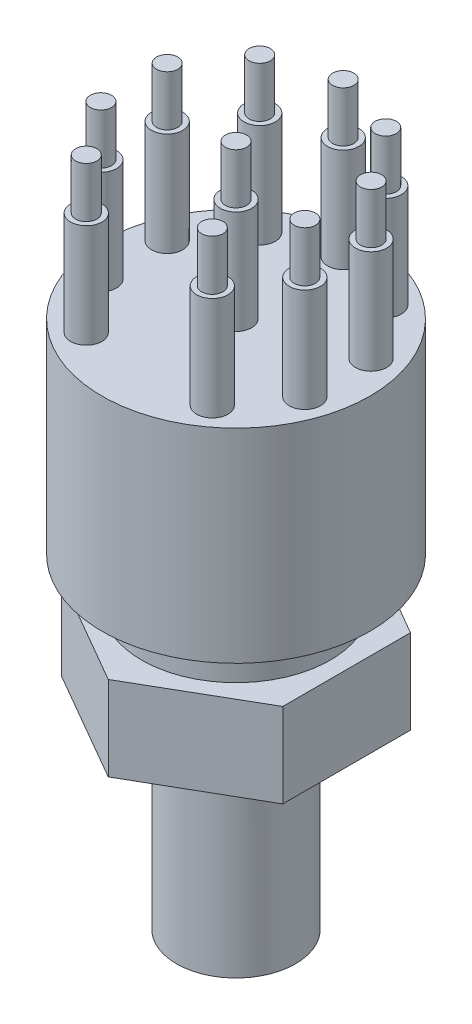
from build123d import *

# Parameters (mm, degrees)
EXTRUDE1_DEPTH    = 7.874
SKETCH2_W         = 8.8011
SKETCH2_H         = 4.18
SKETCH3_R         = 12.5
EXTRUDE2_DEPTH    = 19
SKETCH4_R         = 1.4605
EXTRUDE3_DEPTH    = 9.652
SKETCH5_R         = 0.9906
EXTRUDE4_DEPTH    = 4.699
CIRPATTERN1_COUNT = 10
SKETCH_1_R        = 1.4605
EXTRUDE5_DEPTH    = 9.652
SKETCH_2_R        = 0.9906
EXTRUDE6_DEPTH    = 4.699
SKETCH8_R         = 5.55625
EXTRUDE7_DEPTH    = 18.28030303
SKETCH9_R         = 0.89


with BuildPart() as part:
    # Sketch1 → Extrude1 (new body)
    with BuildSketch(Plane(origin=(0, 0, 0), x_dir=(1, 0, 0), z_dir=(0, 1, 0))):
        Polygon((0, 11.916509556), (-10.32, 5.958254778), (-10.32, -5.958254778), (0, -11.916509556), (10.32, -5.958254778), (10.32, 5.958254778), align=None)
    extrude(amount=EXTRUDE1_DEPTH)

    # Sketch2 → Revolve1 (revolve)
    with BuildSketch(Plane.XY, mode=Mode.PRIVATE) as revolve1_sk:
        with Locations((4.40055, 9.964)):
            Rectangle(SKETCH2_W, SKETCH2_H)
    revolve(revolve1_sk.sketch.rotate(Axis((0, 0, 0), (0, -1, 0)), 180), axis=Axis((0, 0, 0), (0, -1, 0)))

    # Sketch3 → Extrude2 (add)
    with BuildSketch(Plane(origin=(0, 12.054, 0), x_dir=(-1, 0, 0), z_dir=(0, 1, 0))):
        Circle(SKETCH3_R)
    extrude(amount=EXTRUDE2_DEPTH)

    # Sketch4 → Extrude3 (add)
    with BuildSketch(Plane(origin=(0, 31.054, 0), x_dir=(-1, 0, 0), z_dir=(0, 1, 0))):
        with Locations((0, -10)):
            Circle(SKETCH4_R)
    extrude3 = extrude(amount=EXTRUDE3_DEPTH)

    # Sketch5 → Extrude4 (add)
    with BuildSketch(Plane(origin=(0, 40.706, 0), x_dir=(-1, 0, 0), z_dir=(0, 1, 0))):
        with Locations((0, -10)):
            Circle(SKETCH5_R)
    extrude4 = extrude(amount=EXTRUDE4_DEPTH)

    # CirPattern1: Extrude3, Extrude4 ×10 about axis, 1 skipped
    cirpattern1_axis = Axis((0, 0, 0), (0, -1, 0))
    add([extrude3.rotate(cirpattern1_axis, i * 360 / CIRPATTERN1_COUNT) for i in range(1, CIRPATTERN1_COUNT) if i not in (5,)])
    add([extrude4.rotate(cirpattern1_axis, i * 360 / CIRPATTERN1_COUNT) for i in range(1, CIRPATTERN1_COUNT) if i not in (5,)])

    # Sketch 1 → Extrude5 (add)
    with BuildSketch(Plane(origin=(0.09953018, 31.054, 4.480198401), x_dir=(-1, 0, 0), z_dir=(0, 1, 0))):
        with Locations((0.09953018, -4.480198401)):
            Circle(SKETCH_1_R)
    extrude(amount=EXTRUDE5_DEPTH)

    # Sketch 2 → Extrude6 (add)
    with BuildSketch(Plane(origin=(0.09953018, 40.706, 4.480198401), x_dir=(-1, 0, 0), z_dir=(0, 1, 0))):
        with Locations((0.09953018, -4.480198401)):
            Circle(SKETCH_2_R)
    extrude(amount=EXTRUDE6_DEPTH)

    # Sketch8 → Extrude7 (add)
    with BuildSketch(Plane.XZ):
        with Locations(Location((0, 0, 0), (0, 0, 90))):
            Circle(SKETCH8_R)
    extrude(amount=EXTRUDE7_DEPTH)

    # Sketch9 → o-ring 14x1.78 (revolve)
    with BuildSketch(Plane.XY, mode=Mode.PRIVATE) as o_ring_14x1_78_sk:
        with Locations((7.89, 0.284318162)):
            Circle(SKETCH9_R)
    revolve(o_ring_14x1_78_sk.sketch.rotate(Axis((0, 0, 0), (0, -1, 0)), 90), axis=Axis((0, 0, 0), (0, -1, 0)))


solid = part.part
